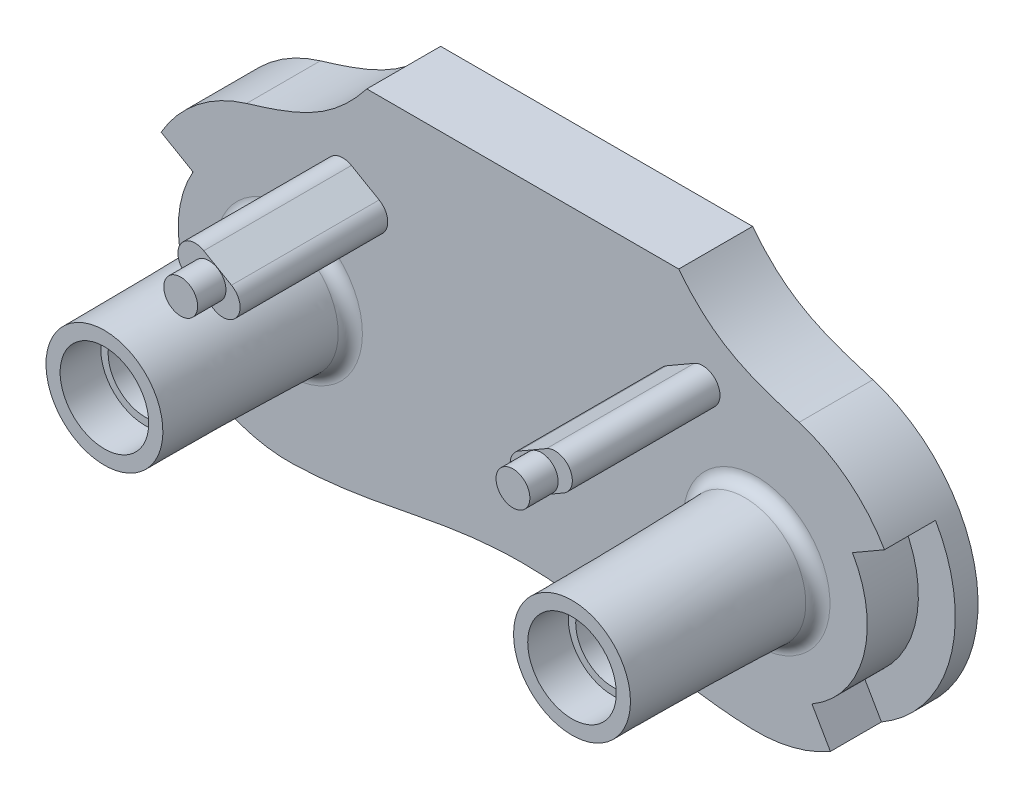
ISO-10303-21;
HEADER;
FILE_DESCRIPTION(('STEP AP214'),'2;1');
FILE_NAME('part.step','',(''),(''),'','','');
FILE_SCHEMA(('AUTOMOTIVE_DESIGN { 1 0 10303 214 1 1 1 1 }'));
ENDSEC;
DATA;
#1=APPLICATION_CONTEXT('core data for automotive mechanical design processes');
#2=APPLICATION_PROTOCOL_DEFINITION('international standard','automotive_design',2000,#1);
#3=PRODUCT_CONTEXT('',#1,'mechanical');
#4=PRODUCT('Part','Part','',(#3));
#5=PRODUCT_RELATED_PRODUCT_CATEGORY('part','',(#4));
#6=PRODUCT_DEFINITION_FORMATION('','',#4);
#7=PRODUCT_DEFINITION_CONTEXT('part definition',#1,'design');
#8=PRODUCT_DEFINITION('design','',#6,#7);
#9=PRODUCT_DEFINITION_SHAPE('','',#8);
#10=(LENGTH_UNIT() NAMED_UNIT(*) SI_UNIT(.MILLI.,.METRE.));
#11=(NAMED_UNIT(*) PLANE_ANGLE_UNIT() SI_UNIT($,.RADIAN.));
#12=(NAMED_UNIT(*) SI_UNIT($,.STERADIAN.) SOLID_ANGLE_UNIT());
#13=UNCERTAINTY_MEASURE_WITH_UNIT(LENGTH_MEASURE(1.E-05),#10,'distance_accuracy_value','');
#14=(GEOMETRIC_REPRESENTATION_CONTEXT(3) GLOBAL_UNCERTAINTY_ASSIGNED_CONTEXT((#13)) GLOBAL_UNIT_ASSIGNED_CONTEXT((#10,
#11,#12)) REPRESENTATION_CONTEXT('',''));
#15=CARTESIAN_POINT('',(0.,0.,0.));
#16=DIRECTION('',(0.,0.,1.));
#17=DIRECTION('',(1.,0.,0.));
#18=AXIS2_PLACEMENT_3D('',#15,#16,#17);
#19=CARTESIAN_POINT('',(-13.5,7.04908888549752,12.));
#20=DIRECTION('',(0.,0.,1.));
#21=DIRECTION('',(1.,0.,0.));
#22=AXIS2_PLACEMENT_3D('',#19,#20,#21);
#23=CYLINDRICAL_SURFACE('',#22,1.375);
#24=CARTESIAN_POINT('',(-13.5,7.04908888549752,12.));
#25=DIRECTION('',(0.,0.,1.));
#26=DIRECTION('',(1.,0.,0.));
#27=AXIS2_PLACEMENT_3D('',#24,#25,#26);
#28=CIRCLE('',#27,1.375);
#29=CARTESIAN_POINT('',(-12.125,7.04908888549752,12.));
#30=VERTEX_POINT('',#29);
#31=EDGE_CURVE('E461',#30,#30,#28,.T.);
#32=ORIENTED_EDGE('',*,*,#31,.T.);
#33=EDGE_LOOP('',(#32));
#34=FACE_BOUND('',#33,.T.);
#35=CARTESIAN_POINT('',(-13.5,7.04908888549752,14.3));
#36=DIRECTION('',(0.,0.,1.));
#37=DIRECTION('',(1.,0.,0.));
#38=AXIS2_PLACEMENT_3D('',#35,#36,#37);
#39=CIRCLE('',#38,1.375);
#40=CARTESIAN_POINT('',(-12.125,7.04908888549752,14.3));
#41=VERTEX_POINT('',#40);
#42=EDGE_CURVE('E47',#41,#41,#39,.F.);
#43=ORIENTED_EDGE('',*,*,#42,.T.);
#44=EDGE_LOOP('',(#43));
#45=FACE_BOUND('',#44,.T.);
#46=ADVANCED_FACE('F44',(#34,#45),#23,.T.);
#47=CARTESIAN_POINT('',(-12.3741669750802,6.39908888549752,14.7));
#48=DIRECTION('',(0.,0.,-1.));
#49=DIRECTION('',(-1.,0.,0.));
#50=AXIS2_PLACEMENT_3D('',#47,#48,#49);
#51=CYLINDRICAL_SURFACE('',#50,1.4);
#52=CARTESIAN_POINT('',(-12.3741669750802,6.39908888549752,12.));
#53=DIRECTION('',(0.,0.,1.));
#54=DIRECTION('',(1.,0.,0.));
#55=AXIS2_PLACEMENT_3D('',#52,#53,#54);
#56=CIRCLE('',#55,1.4);
#57=CARTESIAN_POINT('',(-13.0741669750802,5.1866533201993,12.));
#58=VERTEX_POINT('',#57);
#59=CARTESIAN_POINT('',(-11.6741669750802,7.61152445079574,12.));
#60=VERTEX_POINT('',#59);
#61=EDGE_CURVE('E199',#58,#60,#56,.T.);
#62=ORIENTED_EDGE('',*,*,#61,.F.);
#63=DIRECTION('',(0.,0.,-1.));
#64=VECTOR('',#63,1.);
#65=CARTESIAN_POINT('',(-13.0741669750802,5.1866533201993,14.7));
#66=LINE('',#65,#64);
#67=CARTESIAN_POINT('',(-13.0741669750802,5.1866533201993,0.));
#68=VERTEX_POINT('',#67);
#69=EDGE_CURVE('E214',#58,#68,#66,.T.);
#70=ORIENTED_EDGE('',*,*,#69,.T.);
#71=CARTESIAN_POINT('',(-12.3741669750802,6.39908888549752,0.));
#72=DIRECTION('',(0.,0.,1.));
#73=DIRECTION('',(1.,0.,0.));
#74=AXIS2_PLACEMENT_3D('',#71,#72,#73);
#75=CIRCLE('',#74,1.4);
#76=CARTESIAN_POINT('',(-11.6741669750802,7.61152445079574,0.));
#77=VERTEX_POINT('',#76);
#78=EDGE_CURVE('E255',#68,#77,#75,.T.);
#79=ORIENTED_EDGE('',*,*,#78,.T.);
#80=DIRECTION('',(0.,0.,-1.));
#81=VECTOR('',#80,1.);
#82=CARTESIAN_POINT('',(-11.6741669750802,7.61152445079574,14.7));
#83=LINE('',#82,#81);
#84=EDGE_CURVE('E215',#60,#77,#83,.T.);
#85=ORIENTED_EDGE('',*,*,#84,.F.);
#86=EDGE_LOOP('',(#62,#70,#79,#85));
#87=FACE_BOUND('',#86,.T.);
#88=ADVANCED_FACE('F206',(#87),#51,.T.);
#89=CARTESIAN_POINT('',(-11.6741669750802,7.61152445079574,14.7));
#90=DIRECTION('',(-0.499999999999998,-0.86602540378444,0.));
#91=DIRECTION('',(0.86602540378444,-0.499999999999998,0.));
#92=AXIS2_PLACEMENT_3D('',#89,#90,#91);
#93=PLANE('',#92);
#94=DIRECTION('',(-0.86602540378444,0.499999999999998,0.));
#95=VECTOR('',#94,1.);
#96=CARTESIAN_POINT('',(-11.6741669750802,7.61152445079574,12.));
#97=LINE('',#96,#95);
#98=CARTESIAN_POINT('',(-13.9258330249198,8.91152445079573,12.));
#99=VERTEX_POINT('',#98);
#100=EDGE_CURVE('E213',#60,#99,#97,.T.);
#101=ORIENTED_EDGE('',*,*,#100,.F.);
#102=ORIENTED_EDGE('',*,*,#84,.T.);
#103=DIRECTION('',(-0.86602540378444,0.499999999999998,0.));
#104=VECTOR('',#103,1.);
#105=CARTESIAN_POINT('',(-11.6741669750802,7.61152445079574,0.));
#106=LINE('',#105,#104);
#107=CARTESIAN_POINT('',(-13.9258330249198,8.91152445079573,0.));
#108=VERTEX_POINT('',#107);
#109=EDGE_CURVE('E452',#77,#108,#106,.T.);
#110=ORIENTED_EDGE('',*,*,#109,.T.);
#111=DIRECTION('',(0.,0.,-1.));
#112=VECTOR('',#111,1.);
#113=CARTESIAN_POINT('',(-13.9258330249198,8.91152445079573,14.7));
#114=LINE('',#113,#112);
#115=EDGE_CURVE('E224',#99,#108,#114,.T.);
#116=ORIENTED_EDGE('',*,*,#115,.F.);
#117=EDGE_LOOP('',(#101,#102,#110,#116));
#118=FACE_BOUND('',#117,.T.);
#119=ADVANCED_FACE('F302',(#118),#93,.F.);
#120=CARTESIAN_POINT('',(-14.6258330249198,7.69908888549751,14.7));
#121=DIRECTION('',(0.,0.,-1.));
#122=DIRECTION('',(-1.,0.,0.));
#123=AXIS2_PLACEMENT_3D('',#120,#121,#122);
#124=CYLINDRICAL_SURFACE('',#123,1.4);
#125=CARTESIAN_POINT('',(-14.6258330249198,7.69908888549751,12.));
#126=DIRECTION('',(0.,0.,1.));
#127=DIRECTION('',(1.,0.,0.));
#128=AXIS2_PLACEMENT_3D('',#125,#126,#127);
#129=CIRCLE('',#128,1.4);
#130=CARTESIAN_POINT('',(-15.3258330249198,6.4866533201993,12.));
#131=VERTEX_POINT('',#130);
#132=EDGE_CURVE('E69',#99,#131,#129,.T.);
#133=ORIENTED_EDGE('',*,*,#132,.F.);
#134=ORIENTED_EDGE('',*,*,#115,.T.);
#135=CARTESIAN_POINT('',(-14.6258330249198,7.69908888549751,0.));
#136=DIRECTION('',(0.,0.,1.));
#137=DIRECTION('',(1.,0.,0.));
#138=AXIS2_PLACEMENT_3D('',#135,#136,#137);
#139=CIRCLE('',#138,1.4);
#140=CARTESIAN_POINT('',(-15.3258330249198,6.4866533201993,0.));
#141=VERTEX_POINT('',#140);
#142=EDGE_CURVE('E225',#108,#141,#139,.T.);
#143=ORIENTED_EDGE('',*,*,#142,.T.);
#144=DIRECTION('',(0.,0.,-1.));
#145=VECTOR('',#144,1.);
#146=CARTESIAN_POINT('',(-15.3258330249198,6.4866533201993,14.7));
#147=LINE('',#146,#145);
#148=EDGE_CURVE('E216',#131,#141,#147,.T.);
#149=ORIENTED_EDGE('',*,*,#148,.F.);
#150=EDGE_LOOP('',(#133,#134,#143,#149));
#151=FACE_BOUND('',#150,.T.);
#152=ADVANCED_FACE('F457',(#151),#124,.T.);
#153=CARTESIAN_POINT('',(-13.0741669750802,5.1866533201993,14.7));
#154=DIRECTION('',(0.499999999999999,0.86602540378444,0.));
#155=DIRECTION('',(-0.86602540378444,0.499999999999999,0.));
#156=AXIS2_PLACEMENT_3D('',#153,#154,#155);
#157=PLANE('',#156);
#158=DIRECTION('',(0.86602540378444,-0.499999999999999,0.));
#159=VECTOR('',#158,1.);
#160=CARTESIAN_POINT('',(-13.0741669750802,5.1866533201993,12.));
#161=LINE('',#160,#159);
#162=EDGE_CURVE('E53',#131,#58,#161,.T.);
#163=ORIENTED_EDGE('',*,*,#162,.F.);
#164=ORIENTED_EDGE('',*,*,#148,.T.);
#165=DIRECTION('',(0.866025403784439,-0.499999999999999,0.));
#166=VECTOR('',#165,1.);
#167=CARTESIAN_POINT('',(-13.0741669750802,5.1866533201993,0.));
#168=LINE('',#167,#166);
#169=EDGE_CURVE('E219',#141,#68,#168,.T.);
#170=ORIENTED_EDGE('',*,*,#169,.T.);
#171=ORIENTED_EDGE('',*,*,#69,.F.);
#172=EDGE_LOOP('',(#163,#164,#170,#171));
#173=FACE_BOUND('',#172,.T.);
#174=ADVANCED_FACE('F220',(#173),#157,.F.);
#175=CARTESIAN_POINT('',(19.,-2.4771905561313,-6.));
#176=DIRECTION('',(0.,0.,1.));
#177=DIRECTION('',(1.,0.,0.));
#178=AXIS2_PLACEMENT_3D('',#175,#176,#177);
#179=CYLINDRICAL_SURFACE('',#178,12.);
#180=CARTESIAN_POINT('',(19.,-2.4771905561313,-4.15));
#181=DIRECTION('',(0.,0.,-1.));
#182=DIRECTION('',(-1.,0.,0.));
#183=AXIS2_PLACEMENT_3D('',#180,#181,#182);
#184=CIRCLE('',#183,12.);
#185=CARTESIAN_POINT('',(29.3923048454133,3.52280944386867,-4.15));
#186=VERTEX_POINT('',#185);
#187=CARTESIAN_POINT('',(24.9999999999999,-12.8694954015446,-4.15));
#188=VERTEX_POINT('',#187);
#189=EDGE_CURVE('E475',#186,#188,#184,.T.);
#190=ORIENTED_EDGE('',*,*,#189,.T.);
#191=DIRECTION('',(0.,0.,1.));
#192=VECTOR('',#191,1.);
#193=CARTESIAN_POINT('',(24.9999999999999,-12.8694954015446,-4.15));
#194=LINE('',#193,#192);
#195=CARTESIAN_POINT('',(24.9999999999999,-12.8694954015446,0.));
#196=VERTEX_POINT('',#195);
#197=EDGE_CURVE('E495',#188,#196,#194,.T.);
#198=ORIENTED_EDGE('',*,*,#197,.T.);
#199=CARTESIAN_POINT('',(19.,-2.4771905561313,0.));
#200=DIRECTION('',(0.,0.,1.));
#201=DIRECTION('',(-1.,0.,0.));
#202=AXIS2_PLACEMENT_3D('',#199,#200,#201);
#203=CIRCLE('',#202,12.);
#204=CARTESIAN_POINT('',(18.5752367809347,-14.4696705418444,0.));
#205=VERTEX_POINT('',#204);
#206=EDGE_CURVE('E651',#205,#196,#203,.T.);
#207=ORIENTED_EDGE('',*,*,#206,.F.);
#208=DIRECTION('',(0.,0.,1.));
#209=VECTOR('',#208,1.);
#210=CARTESIAN_POINT('',(18.5752367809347,-14.4696705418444,-6.));
#211=LINE('',#210,#209);
#212=CARTESIAN_POINT('',(18.5752367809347,-14.4696705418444,-6.));
#213=VERTEX_POINT('',#212);
#214=EDGE_CURVE('E688',#213,#205,#211,.T.);
#215=ORIENTED_EDGE('',*,*,#214,.F.);
#216=CARTESIAN_POINT('',(19.,-2.4771905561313,-6.));
#217=DIRECTION('',(0.,0.,1.));
#218=DIRECTION('',(-1.,0.,0.));
#219=AXIS2_PLACEMENT_3D('',#216,#217,#218);
#220=CIRCLE('',#219,12.);
#221=CARTESIAN_POINT('',(22.4481746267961,9.01672486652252,-6.));
#222=VERTEX_POINT('',#221);
#223=EDGE_CURVE('E710',#213,#222,#220,.T.);
#224=ORIENTED_EDGE('',*,*,#223,.T.);
#225=DIRECTION('',(0.,0.,1.));
#226=VECTOR('',#225,1.);
#227=CARTESIAN_POINT('',(22.4481746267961,9.01672486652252,-6.));
#228=LINE('',#227,#226);
#229=CARTESIAN_POINT('',(22.4481746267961,9.01672486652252,0.));
#230=VERTEX_POINT('',#229);
#231=EDGE_CURVE('E686',#222,#230,#228,.T.);
#232=ORIENTED_EDGE('',*,*,#231,.T.);
#233=CARTESIAN_POINT('',(29.3923048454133,3.52280944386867,0.));
#234=VERTEX_POINT('',#233);
#235=EDGE_CURVE('E649',#234,#230,#203,.T.);
#236=ORIENTED_EDGE('',*,*,#235,.F.);
#237=DIRECTION('',(0.,0.,1.));
#238=VECTOR('',#237,1.);
#239=CARTESIAN_POINT('',(29.3923048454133,3.52280944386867,-4.15));
#240=LINE('',#239,#238);
#241=EDGE_CURVE('E485',#186,#234,#240,.T.);
#242=ORIENTED_EDGE('',*,*,#241,.F.);
#243=EDGE_LOOP('',(#190,#198,#207,#215,#224,#232,#236,#242));
#244=FACE_BOUND('',#243,.T.);
#245=ADVANCED_FACE('F612',(#244),#179,.T.);
#246=CARTESIAN_POINT('',(-19.,-2.4771905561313,-6.));
#247=DIRECTION('',(0.,0.,1.));
#248=DIRECTION('',(1.,0.,0.));
#249=AXIS2_PLACEMENT_3D('',#246,#247,#248);
#250=CYLINDRICAL_SURFACE('',#249,12.);
#251=CARTESIAN_POINT('',(-19.,-2.4771905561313,-4.15));
#252=DIRECTION('',(0.,0.,1.));
#253=DIRECTION('',(1.,0.,0.));
#254=AXIS2_PLACEMENT_3D('',#251,#252,#253);
#255=CIRCLE('',#254,12.);
#256=CARTESIAN_POINT('',(-29.3923048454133,3.52280944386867,-4.15));
#257=VERTEX_POINT('',#256);
#258=CARTESIAN_POINT('',(-24.9999999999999,-12.8694954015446,-4.15));
#259=VERTEX_POINT('',#258);
#260=EDGE_CURVE('E501',#257,#259,#255,.T.);
#261=ORIENTED_EDGE('',*,*,#260,.F.);
#262=DIRECTION('',(0.,0.,1.));
#263=VECTOR('',#262,1.);
#264=CARTESIAN_POINT('',(-29.3923048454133,3.52280944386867,-4.15));
#265=LINE('',#264,#263);
#266=CARTESIAN_POINT('',(-29.3923048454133,3.52280944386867,0.));
#267=VERTEX_POINT('',#266);
#268=EDGE_CURVE('E516',#257,#267,#265,.T.);
#269=ORIENTED_EDGE('',*,*,#268,.T.);
#270=CARTESIAN_POINT('',(-19.,-2.4771905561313,0.));
#271=DIRECTION('',(0.,0.,1.));
#272=DIRECTION('',(1.,0.,0.));
#273=AXIS2_PLACEMENT_3D('',#270,#271,#272);
#274=CIRCLE('',#273,12.);
#275=CARTESIAN_POINT('',(-22.4481746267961,9.01672486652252,0.));
#276=VERTEX_POINT('',#275);
#277=EDGE_CURVE('E259',#276,#267,#274,.T.);
#278=ORIENTED_EDGE('',*,*,#277,.F.);
#279=DIRECTION('',(0.,0.,1.));
#280=VECTOR('',#279,1.);
#281=CARTESIAN_POINT('',(-22.4481746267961,9.01672486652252,-6.));
#282=LINE('',#281,#280);
#283=CARTESIAN_POINT('',(-22.4481746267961,9.01672486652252,-6.));
#284=VERTEX_POINT('',#283);
#285=EDGE_CURVE('E682',#284,#276,#282,.T.);
#286=ORIENTED_EDGE('',*,*,#285,.F.);
#287=CARTESIAN_POINT('',(-19.,-2.4771905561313,-6.));
#288=DIRECTION('',(0.,0.,1.));
#289=DIRECTION('',(1.,0.,0.));
#290=AXIS2_PLACEMENT_3D('',#287,#288,#289);
#291=CIRCLE('',#290,12.);
#292=CARTESIAN_POINT('',(-18.5752367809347,-14.4696705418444,-6.));
#293=VERTEX_POINT('',#292);
#294=EDGE_CURVE('E626',#284,#293,#291,.T.);
#295=ORIENTED_EDGE('',*,*,#294,.T.);
#296=DIRECTION('',(0.,0.,1.));
#297=VECTOR('',#296,1.);
#298=CARTESIAN_POINT('',(-18.5752367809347,-14.4696705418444,-6.));
#299=LINE('',#298,#297);
#300=CARTESIAN_POINT('',(-18.5752367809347,-14.4696705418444,0.));
#301=VERTEX_POINT('',#300);
#302=EDGE_CURVE('E561',#293,#301,#299,.T.);
#303=ORIENTED_EDGE('',*,*,#302,.T.);
#304=CARTESIAN_POINT('',(-24.9999999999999,-12.8694954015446,0.));
#305=VERTEX_POINT('',#304);
#306=EDGE_CURVE('E672',#305,#301,#274,.T.);
#307=ORIENTED_EDGE('',*,*,#306,.F.);
#308=DIRECTION('',(0.,0.,1.));
#309=VECTOR('',#308,1.);
#310=CARTESIAN_POINT('',(-24.9999999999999,-12.8694954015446,-4.15));
#311=LINE('',#310,#309);
#312=EDGE_CURVE('E515',#259,#305,#311,.T.);
#313=ORIENTED_EDGE('',*,*,#312,.F.);
#314=EDGE_LOOP('',(#261,#269,#278,#286,#295,#303,#307,#313));
#315=FACE_BOUND('',#314,.T.);
#316=ADVANCED_FACE('F368',(#315),#250,.T.);
#317=CARTESIAN_POINT('',(19.,-2.4771905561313,20.));
#318=DIRECTION('',(0.,0.,-1.));
#319=DIRECTION('',(-1.,0.,0.));
#320=AXIS2_PLACEMENT_3D('',#317,#318,#319);
#321=CYLINDRICAL_SURFACE('',#320,3.);
#322=CARTESIAN_POINT('',(19.,-2.4771905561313,-6.));
#323=DIRECTION('',(0.,0.,-1.));
#324=DIRECTION('',(-1.,0.,0.));
#325=AXIS2_PLACEMENT_3D('',#322,#323,#324);
#326=CIRCLE('',#325,3.);
#327=CARTESIAN_POINT('',(16.,-2.4771905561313,-6.));
#328=VERTEX_POINT('',#327);
#329=EDGE_CURVE('E545',#328,#328,#326,.F.);
#330=ORIENTED_EDGE('',*,*,#329,.F.);
#331=EDGE_LOOP('',(#330));
#332=FACE_BOUND('',#331,.T.);
#333=CARTESIAN_POINT('',(19.,-2.4771905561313,11.7));
#334=DIRECTION('',(0.,0.,1.));
#335=DIRECTION('',(1.,0.,0.));
#336=AXIS2_PLACEMENT_3D('',#333,#334,#335);
#337=CIRCLE('',#336,3.);
#338=CARTESIAN_POINT('',(22.,-2.4771905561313,11.7));
#339=VERTEX_POINT('',#338);
#340=EDGE_CURVE('E535',#339,#339,#337,.T.);
#341=ORIENTED_EDGE('',*,*,#340,.T.);
#342=EDGE_LOOP('',(#341));
#343=FACE_BOUND('',#342,.T.);
#344=ADVANCED_FACE('F363',(#332,#343),#321,.F.);
#345=CARTESIAN_POINT('',(-19.,-2.4771905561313,20.));
#346=DIRECTION('',(0.,0.,-1.));
#347=DIRECTION('',(-1.,0.,0.));
#348=AXIS2_PLACEMENT_3D('',#345,#346,#347);
#349=CYLINDRICAL_SURFACE('',#348,3.);
#350=CARTESIAN_POINT('',(-19.,-2.4771905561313,-6.));
#351=DIRECTION('',(0.,0.,-1.));
#352=DIRECTION('',(-1.,0.,0.));
#353=AXIS2_PLACEMENT_3D('',#350,#351,#352);
#354=CIRCLE('',#353,3.);
#355=CARTESIAN_POINT('',(-22.,-2.4771905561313,-6.));
#356=VERTEX_POINT('',#355);
#357=EDGE_CURVE('E544',#356,#356,#354,.F.);
#358=ORIENTED_EDGE('',*,*,#357,.F.);
#359=EDGE_LOOP('',(#358));
#360=FACE_BOUND('',#359,.T.);
#361=CARTESIAN_POINT('',(-19.,-2.4771905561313,11.7));
#362=DIRECTION('',(0.,0.,1.));
#363=DIRECTION('',(1.,0.,0.));
#364=AXIS2_PLACEMENT_3D('',#361,#362,#363);
#365=CIRCLE('',#364,3.);
#366=CARTESIAN_POINT('',(-16.,-2.4771905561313,11.7));
#367=VERTEX_POINT('',#366);
#368=EDGE_CURVE('E540',#367,#367,#365,.T.);
#369=ORIENTED_EDGE('',*,*,#368,.T.);
#370=EDGE_LOOP('',(#369));
#371=FACE_BOUND('',#370,.T.);
#372=ADVANCED_FACE('F364',(#360,#371),#349,.F.);
#373=CARTESIAN_POINT('',(-9.17558471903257,-13.1948473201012,0.));
#374=DIRECTION('',(0.,0.,-1.));
#375=DIRECTION('',(-1.,0.,0.));
#376=AXIS2_PLACEMENT_3D('',#373,#374,#375);
#377=PLANE('',#376);
#378=CARTESIAN_POINT('',(19.,-2.4771905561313,0.));
#379=DIRECTION('',(0.,0.,1.));
#380=DIRECTION('',(-1.,0.,0.));
#381=AXIS2_PLACEMENT_3D('',#378,#379,#380);
#382=CIRCLE('',#381,9.);
#383=CARTESIAN_POINT('',(23.5,-10.2714191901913,0.));
#384=VERTEX_POINT('',#383);
#385=CARTESIAN_POINT('',(26.79422863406,2.02280944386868,0.));
#386=VERTEX_POINT('',#385);
#387=EDGE_CURVE('E490',#384,#386,#382,.T.);
#388=ORIENTED_EDGE('',*,*,#387,.T.);
#389=DIRECTION('',(0.86602540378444,0.499999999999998,0.));
#390=VECTOR('',#389,1.);
#391=CARTESIAN_POINT('',(26.79422863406,2.02280944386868,0.));
#392=LINE('',#391,#390);
#393=EDGE_CURVE('E472',#386,#234,#392,.T.);
#394=ORIENTED_EDGE('',*,*,#393,.T.);
#395=ORIENTED_EDGE('',*,*,#235,.T.);
#396=CARTESIAN_POINT('',(22.4481746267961,9.01672486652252,0.));
#397=CARTESIAN_POINT('',(18.2187669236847,10.2855471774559,0.));
#398=CARTESIAN_POINT('',(15.492615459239,11.3176864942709,0.));
#399=CARTESIAN_POINT('',(12.6747991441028,14.9250647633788,0.));
#400=B_SPLINE_CURVE_WITH_KNOTS('',3,(#396,#397,#398,#399),.UNSPECIFIED.,.F.,.F.,(4,4),(0.,1.),.UNSPECIFIED.);
#401=CARTESIAN_POINT('',(12.6747991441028,14.9250647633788,0.));
#402=VERTEX_POINT('',#401);
#403=EDGE_CURVE('E660',#230,#402,#400,.T.);
#404=ORIENTED_EDGE('',*,*,#403,.T.);
#405=DIRECTION('',(-1.,0.,0.));
#406=VECTOR('',#405,1.);
#407=CARTESIAN_POINT('',(-12.6747991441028,14.9250647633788,0.));
#408=LINE('',#407,#406);
#409=CARTESIAN_POINT('',(-12.6747991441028,14.9250647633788,0.));
#410=VERTEX_POINT('',#409);
#411=EDGE_CURVE('E661',#402,#410,#408,.T.);
#412=ORIENTED_EDGE('',*,*,#411,.T.);
#413=CARTESIAN_POINT('',(-12.6747991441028,14.9250647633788,0.));
#414=CARTESIAN_POINT('',(-15.492615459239,11.3176864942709,0.));
#415=CARTESIAN_POINT('',(-18.2187669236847,10.2855471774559,0.));
#416=CARTESIAN_POINT('',(-22.4481746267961,9.01672486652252,0.));
#417=B_SPLINE_CURVE_WITH_KNOTS('',3,(#413,#414,#415,#416),.UNSPECIFIED.,.F.,.F.,(4,4),(0.,1.),.UNSPECIFIED.);
#418=EDGE_CURVE('E668',#410,#276,#417,.T.);
#419=ORIENTED_EDGE('',*,*,#418,.T.);
#420=ORIENTED_EDGE('',*,*,#277,.T.);
#421=DIRECTION('',(-0.86602540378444,0.499999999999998,0.));
#422=VECTOR('',#421,1.);
#423=CARTESIAN_POINT('',(-26.79422863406,2.02280944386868,0.));
#424=LINE('',#423,#422);
#425=CARTESIAN_POINT('',(-26.79422863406,2.02280944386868,0.));
#426=VERTEX_POINT('',#425);
#427=EDGE_CURVE('E504',#426,#267,#424,.T.);
#428=ORIENTED_EDGE('',*,*,#427,.F.);
#429=CARTESIAN_POINT('',(-19.,-2.4771905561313,0.));
#430=DIRECTION('',(0.,0.,-1.));
#431=DIRECTION('',(1.,0.,0.));
#432=AXIS2_PLACEMENT_3D('',#429,#430,#431);
#433=CIRCLE('',#432,9.);
#434=CARTESIAN_POINT('',(-23.5,-10.2714191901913,0.));
#435=VERTEX_POINT('',#434);
#436=EDGE_CURVE('E517',#435,#426,#433,.T.);
#437=ORIENTED_EDGE('',*,*,#436,.F.);
#438=DIRECTION('',(0.499999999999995,0.866025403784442,0.));
#439=VECTOR('',#438,1.);
#440=CARTESIAN_POINT('',(-23.4999999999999,-10.2714191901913,0.));
#441=LINE('',#440,#439);
#442=EDGE_CURVE('E494',#305,#435,#441,.T.);
#443=ORIENTED_EDGE('',*,*,#442,.F.);
#444=ORIENTED_EDGE('',*,*,#306,.T.);
#445=CARTESIAN_POINT('',(-18.5752367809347,-14.4696705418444,0.));
#446=CARTESIAN_POINT('',(-11.393763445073,-14.215308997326,0.));
#447=CARTESIAN_POINT('',(-6.88271687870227,-12.1107952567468,0.));
#448=CARTESIAN_POINT('',(0.,-12.1107952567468,0.));
#449=B_SPLINE_CURVE_WITH_KNOTS('',3,(#445,#446,#447,#448),.UNSPECIFIED.,.F.,.F.,(4,4),(0.,1.),.UNSPECIFIED.);
#450=CARTESIAN_POINT('',(0.,-12.1107952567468,0.));
#451=VERTEX_POINT('',#450);
#452=EDGE_CURVE('E226',#301,#451,#449,.T.);
#453=ORIENTED_EDGE('',*,*,#452,.T.);
#454=CARTESIAN_POINT('',(0.,-12.1107952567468,0.));
#455=CARTESIAN_POINT('',(6.88271687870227,-12.1107952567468,0.));
#456=CARTESIAN_POINT('',(11.393763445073,-14.215308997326,0.));
#457=CARTESIAN_POINT('',(18.5752367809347,-14.4696705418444,0.));
#458=B_SPLINE_CURVE_WITH_KNOTS('',3,(#454,#455,#456,#457),.UNSPECIFIED.,.F.,.F.,(4,4),(0.,1.),.UNSPECIFIED.);
#459=EDGE_CURVE('E645',#451,#205,#458,.T.);
#460=ORIENTED_EDGE('',*,*,#459,.T.);
#461=ORIENTED_EDGE('',*,*,#206,.T.);
#462=DIRECTION('',(-0.499999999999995,0.866025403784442,0.));
#463=VECTOR('',#462,1.);
#464=CARTESIAN_POINT('',(23.4999999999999,-10.2714191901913,0.));
#465=LINE('',#464,#463);
#466=EDGE_CURVE('E478',#196,#384,#465,.T.);
#467=ORIENTED_EDGE('',*,*,#466,.T.);
#468=EDGE_LOOP('',(#388,#394,#395,#404,#412,#419,#420,#428,#437,#443,#444,#453,#460,#461,#467));
#469=FACE_BOUND('',#468,.T.);
#470=CARTESIAN_POINT('',(19.,-2.4771905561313,0.));
#471=DIRECTION('',(0.,0.,-1.));
#472=DIRECTION('',(-1.,0.,0.));
#473=AXIS2_PLACEMENT_3D('',#470,#471,#472);
#474=CIRCLE('',#473,5.96625720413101);
#475=CARTESIAN_POINT('',(13.033742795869,-2.4771905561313,0.));
#476=VERTEX_POINT('',#475);
#477=EDGE_CURVE('E565',#476,#476,#474,.T.);
#478=ORIENTED_EDGE('',*,*,#477,.T.);
#479=EDGE_LOOP('',(#478));
#480=FACE_BOUND('',#479,.T.);
#481=CARTESIAN_POINT('',(-19.,-2.4771905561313,0.));
#482=DIRECTION('',(0.,0.,-1.));
#483=DIRECTION('',(-1.,0.,0.));
#484=AXIS2_PLACEMENT_3D('',#481,#482,#483);
#485=CIRCLE('',#484,5.966257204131);
#486=CARTESIAN_POINT('',(-24.966257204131,-2.4771905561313,0.));
#487=VERTEX_POINT('',#486);
#488=EDGE_CURVE('E560',#487,#487,#485,.T.);
#489=ORIENTED_EDGE('',*,*,#488,.T.);
#490=EDGE_LOOP('',(#489));
#491=FACE_BOUND('',#490,.T.);
#492=CARTESIAN_POINT('',(12.3741669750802,6.39908888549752,0.));
#493=DIRECTION('',(0.,0.,1.));
#494=DIRECTION('',(-1.,0.,0.));
#495=AXIS2_PLACEMENT_3D('',#492,#493,#494);
#496=CIRCLE('',#495,1.4);
#497=CARTESIAN_POINT('',(11.6741669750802,7.61152445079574,0.));
#498=VERTEX_POINT('',#497);
#499=CARTESIAN_POINT('',(13.0741669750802,5.1866533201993,0.));
#500=VERTEX_POINT('',#499);
#501=EDGE_CURVE('E250',#498,#500,#496,.T.);
#502=ORIENTED_EDGE('',*,*,#501,.F.);
#503=DIRECTION('',(-0.86602540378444,-0.499999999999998,0.));
#504=VECTOR('',#503,1.);
#505=CARTESIAN_POINT('',(11.6741669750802,7.61152445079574,0.));
#506=LINE('',#505,#504);
#507=CARTESIAN_POINT('',(13.9258330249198,8.91152445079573,0.));
#508=VERTEX_POINT('',#507);
#509=EDGE_CURVE('E237',#508,#498,#506,.T.);
#510=ORIENTED_EDGE('',*,*,#509,.F.);
#511=CARTESIAN_POINT('',(14.6258330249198,7.69908888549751,0.));
#512=DIRECTION('',(0.,0.,1.));
#513=DIRECTION('',(-1.,0.,0.));
#514=AXIS2_PLACEMENT_3D('',#511,#512,#513);
#515=CIRCLE('',#514,1.4);
#516=CARTESIAN_POINT('',(15.3258330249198,6.48665332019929,0.));
#517=VERTEX_POINT('',#516);
#518=EDGE_CURVE('E243',#517,#508,#515,.T.);
#519=ORIENTED_EDGE('',*,*,#518,.F.);
#520=DIRECTION('',(0.86602540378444,0.499999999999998,0.));
#521=VECTOR('',#520,1.);
#522=CARTESIAN_POINT('',(13.0741669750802,5.1866533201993,0.));
#523=LINE('',#522,#521);
#524=EDGE_CURVE('E248',#500,#517,#523,.T.);
#525=ORIENTED_EDGE('',*,*,#524,.F.);
#526=EDGE_LOOP('',(#502,#510,#519,#525));
#527=FACE_BOUND('',#526,.T.);
#528=ORIENTED_EDGE('',*,*,#78,.F.);
#529=ORIENTED_EDGE('',*,*,#169,.F.);
#530=ORIENTED_EDGE('',*,*,#142,.F.);
#531=ORIENTED_EDGE('',*,*,#109,.F.);
#532=EDGE_LOOP('',(#528,#529,#530,#531));
#533=FACE_BOUND('',#532,.T.);
#534=ADVANCED_FACE('F273',(#469,#480,#491,#527,#533),#377,.F.);
#535=CARTESIAN_POINT('',(-18.5752367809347,-14.4696705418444,-6.));
#536=CARTESIAN_POINT('',(-11.393763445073,-14.215308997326,-6.));
#537=CARTESIAN_POINT('',(-6.88271687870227,-12.1107952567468,-6.));
#538=CARTESIAN_POINT('',(0.,-12.1107952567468,-6.));
#539=B_SPLINE_CURVE_WITH_KNOTS('',3,(#535,#536,#537,#538),.UNSPECIFIED.,.F.,.F.,(4,4),(0.,1.),.UNSPECIFIED.);
#540=DIRECTION('',(0.,0.,1.));
#541=VECTOR('',#540,1.);
#542=SURFACE_OF_LINEAR_EXTRUSION('',#539,#541);
#543=ORIENTED_EDGE('',*,*,#452,.F.);
#544=ORIENTED_EDGE('',*,*,#302,.F.);
#545=CARTESIAN_POINT('',(0.,-12.1107952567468,-6.));
#546=VERTEX_POINT('',#545);
#547=EDGE_CURVE('E253',#293,#546,#539,.T.);
#548=ORIENTED_EDGE('',*,*,#547,.T.);
#549=DIRECTION('',(0.,0.,1.));
#550=VECTOR('',#549,1.);
#551=CARTESIAN_POINT('',(0.,-12.1107952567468,-6.));
#552=LINE('',#551,#550);
#553=EDGE_CURVE('E557',#546,#451,#552,.T.);
#554=ORIENTED_EDGE('',*,*,#553,.T.);
#555=EDGE_LOOP('',(#543,#544,#548,#554));
#556=FACE_BOUND('',#555,.T.);
#557=ADVANCED_FACE('F267',(#556),#542,.T.);
#558=CARTESIAN_POINT('',(-12.6747991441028,14.9250647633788,-6.));
#559=CARTESIAN_POINT('',(-15.492615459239,11.3176864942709,-6.));
#560=CARTESIAN_POINT('',(-18.2187669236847,10.2855471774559,-6.));
#561=CARTESIAN_POINT('',(-22.4481746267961,9.01672486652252,-6.));
#562=B_SPLINE_CURVE_WITH_KNOTS('',3,(#558,#559,#560,#561),.UNSPECIFIED.,.F.,.F.,(4,4),(0.,1.),.UNSPECIFIED.);
#563=DIRECTION('',(0.,0.,1.));
#564=VECTOR('',#563,1.);
#565=SURFACE_OF_LINEAR_EXTRUSION('',#562,#564);
#566=ORIENTED_EDGE('',*,*,#418,.F.);
#567=DIRECTION('',(0.,0.,1.));
#568=VECTOR('',#567,1.);
#569=CARTESIAN_POINT('',(-12.6747991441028,14.9250647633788,-6.));
#570=LINE('',#569,#568);
#571=CARTESIAN_POINT('',(-12.6747991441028,14.9250647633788,-6.));
#572=VERTEX_POINT('',#571);
#573=EDGE_CURVE('E681',#572,#410,#570,.T.);
#574=ORIENTED_EDGE('',*,*,#573,.F.);
#575=EDGE_CURVE('E622',#572,#284,#562,.T.);
#576=ORIENTED_EDGE('',*,*,#575,.T.);
#577=ORIENTED_EDGE('',*,*,#285,.T.);
#578=EDGE_LOOP('',(#566,#574,#576,#577));
#579=FACE_BOUND('',#578,.T.);
#580=ADVANCED_FACE('F275',(#579),#565,.T.);
#581=CARTESIAN_POINT('',(-12.6747991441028,14.9250647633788,-6.));
#582=DIRECTION('',(0.,1.,0.));
#583=DIRECTION('',(0.,0.,1.));
#584=AXIS2_PLACEMENT_3D('',#581,#582,#583);
#585=PLANE('',#584);
#586=ORIENTED_EDGE('',*,*,#411,.F.);
#587=DIRECTION('',(0.,0.,1.));
#588=VECTOR('',#587,1.);
#589=CARTESIAN_POINT('',(12.6747991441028,14.9250647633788,-6.));
#590=LINE('',#589,#588);
#591=CARTESIAN_POINT('',(12.6747991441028,14.9250647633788,-6.));
#592=VERTEX_POINT('',#591);
#593=EDGE_CURVE('E683',#592,#402,#590,.T.);
#594=ORIENTED_EDGE('',*,*,#593,.F.);
#595=DIRECTION('',(-1.,0.,0.));
#596=VECTOR('',#595,1.);
#597=CARTESIAN_POINT('',(-12.6747991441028,14.9250647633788,-6.));
#598=LINE('',#597,#596);
#599=EDGE_CURVE('E633',#592,#572,#598,.T.);
#600=ORIENTED_EDGE('',*,*,#599,.T.);
#601=ORIENTED_EDGE('',*,*,#573,.T.);
#602=EDGE_LOOP('',(#586,#594,#600,#601));
#603=FACE_BOUND('',#602,.T.);
#604=ADVANCED_FACE('F616',(#603),#585,.T.);
#605=CARTESIAN_POINT('',(22.4481746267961,9.01672486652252,-6.));
#606=CARTESIAN_POINT('',(18.2187669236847,10.2855471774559,-6.));
#607=CARTESIAN_POINT('',(15.492615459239,11.3176864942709,-6.));
#608=CARTESIAN_POINT('',(12.6747991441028,14.9250647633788,-6.));
#609=B_SPLINE_CURVE_WITH_KNOTS('',3,(#605,#606,#607,#608),.UNSPECIFIED.,.F.,.F.,(4,4),(0.,1.),.UNSPECIFIED.);
#610=DIRECTION('',(0.,0.,1.));
#611=VECTOR('',#610,1.);
#612=SURFACE_OF_LINEAR_EXTRUSION('',#609,#611);
#613=ORIENTED_EDGE('',*,*,#403,.F.);
#614=ORIENTED_EDGE('',*,*,#231,.F.);
#615=EDGE_CURVE('E709',#222,#592,#609,.T.);
#616=ORIENTED_EDGE('',*,*,#615,.T.);
#617=ORIENTED_EDGE('',*,*,#593,.T.);
#618=EDGE_LOOP('',(#613,#614,#616,#617));
#619=FACE_BOUND('',#618,.T.);
#620=ADVANCED_FACE('F717',(#619),#612,.T.);
#621=CARTESIAN_POINT('',(0.,-12.1107952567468,-6.));
#622=CARTESIAN_POINT('',(6.88271687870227,-12.1107952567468,-6.));
#623=CARTESIAN_POINT('',(11.393763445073,-14.215308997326,-6.));
#624=CARTESIAN_POINT('',(18.5752367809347,-14.4696705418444,-6.));
#625=B_SPLINE_CURVE_WITH_KNOTS('',3,(#621,#622,#623,#624),.UNSPECIFIED.,.F.,.F.,(4,4),(0.,1.),.UNSPECIFIED.);
#626=DIRECTION('',(0.,0.,1.));
#627=VECTOR('',#626,1.);
#628=SURFACE_OF_LINEAR_EXTRUSION('',#625,#627);
#629=ORIENTED_EDGE('',*,*,#459,.F.);
#630=ORIENTED_EDGE('',*,*,#553,.F.);
#631=EDGE_CURVE('E260',#546,#213,#625,.T.);
#632=ORIENTED_EDGE('',*,*,#631,.T.);
#633=ORIENTED_EDGE('',*,*,#214,.T.);
#634=EDGE_LOOP('',(#629,#630,#632,#633));
#635=FACE_BOUND('',#634,.T.);
#636=ADVANCED_FACE('F274',(#635),#628,.T.);
#637=CARTESIAN_POINT('',(-9.17558471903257,-13.1948473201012,-6.));
#638=DIRECTION('',(0.,0.,-1.));
#639=DIRECTION('',(-1.,0.,0.));
#640=AXIS2_PLACEMENT_3D('',#637,#638,#639);
#641=PLANE('',#640);
#642=ORIENTED_EDGE('',*,*,#357,.T.);
#643=EDGE_LOOP('',(#642));
#644=FACE_BOUND('',#643,.T.);
#645=ORIENTED_EDGE('',*,*,#329,.T.);
#646=EDGE_LOOP('',(#645));
#647=FACE_BOUND('',#646,.T.);
#648=ORIENTED_EDGE('',*,*,#547,.F.);
#649=ORIENTED_EDGE('',*,*,#294,.F.);
#650=ORIENTED_EDGE('',*,*,#575,.F.);
#651=ORIENTED_EDGE('',*,*,#599,.F.);
#652=ORIENTED_EDGE('',*,*,#615,.F.);
#653=ORIENTED_EDGE('',*,*,#223,.F.);
#654=ORIENTED_EDGE('',*,*,#631,.F.);
#655=EDGE_LOOP('',(#648,#649,#650,#651,#652,#653,#654));
#656=FACE_BOUND('',#655,.T.);
#657=ADVANCED_FACE('F550',(#644,#647,#656),#641,.T.);
#658=CARTESIAN_POINT('',(12.3741669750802,6.39908888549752,14.7));
#659=DIRECTION('',(0.,0.,-1.));
#660=DIRECTION('',(-1.,0.,0.));
#661=AXIS2_PLACEMENT_3D('',#658,#659,#660);
#662=CYLINDRICAL_SURFACE('',#661,1.4);
#663=DIRECTION('',(0.,0.,-1.));
#664=VECTOR('',#663,1.);
#665=CARTESIAN_POINT('',(13.0741669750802,5.1866533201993,14.7));
#666=LINE('',#665,#664);
#667=CARTESIAN_POINT('',(13.0741669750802,5.1866533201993,12.));
#668=VERTEX_POINT('',#667);
#669=EDGE_CURVE('E232',#668,#500,#666,.T.);
#670=ORIENTED_EDGE('',*,*,#669,.F.);
#671=CARTESIAN_POINT('',(12.3741669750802,6.39908888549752,12.));
#672=DIRECTION('',(0.,0.,-1.));
#673=DIRECTION('',(-1.,0.,0.));
#674=AXIS2_PLACEMENT_3D('',#671,#672,#673);
#675=CIRCLE('',#674,1.4);
#676=CARTESIAN_POINT('',(11.6741669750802,7.61152445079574,12.));
#677=VERTEX_POINT('',#676);
#678=EDGE_CURVE('E466',#668,#677,#675,.T.);
#679=ORIENTED_EDGE('',*,*,#678,.T.);
#680=DIRECTION('',(0.,0.,-1.));
#681=VECTOR('',#680,1.);
#682=CARTESIAN_POINT('',(11.6741669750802,7.61152445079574,14.7));
#683=LINE('',#682,#681);
#684=EDGE_CURVE('E240',#677,#498,#683,.T.);
#685=ORIENTED_EDGE('',*,*,#684,.T.);
#686=ORIENTED_EDGE('',*,*,#501,.T.);
#687=EDGE_LOOP('',(#670,#679,#685,#686));
#688=FACE_BOUND('',#687,.T.);
#689=ADVANCED_FACE('F599',(#688),#662,.T.);
#690=CARTESIAN_POINT('',(13.0741669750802,5.1866533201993,14.7));
#691=DIRECTION('',(-0.499999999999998,0.86602540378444,0.));
#692=DIRECTION('',(-0.86602540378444,-0.499999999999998,0.));
#693=AXIS2_PLACEMENT_3D('',#690,#691,#692);
#694=PLANE('',#693);
#695=DIRECTION('',(0.,0.,-1.));
#696=VECTOR('',#695,1.);
#697=CARTESIAN_POINT('',(15.3258330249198,6.48665332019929,14.7));
#698=LINE('',#697,#696);
#699=CARTESIAN_POINT('',(15.3258330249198,6.48665332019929,12.));
#700=VERTEX_POINT('',#699);
#701=EDGE_CURVE('E231',#700,#517,#698,.T.);
#702=ORIENTED_EDGE('',*,*,#701,.F.);
#703=DIRECTION('',(-0.86602540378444,-0.499999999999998,0.));
#704=VECTOR('',#703,1.);
#705=CARTESIAN_POINT('',(13.0741669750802,5.1866533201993,12.));
#706=LINE('',#705,#704);
#707=EDGE_CURVE('E470',#700,#668,#706,.T.);
#708=ORIENTED_EDGE('',*,*,#707,.T.);
#709=ORIENTED_EDGE('',*,*,#669,.T.);
#710=ORIENTED_EDGE('',*,*,#524,.T.);
#711=EDGE_LOOP('',(#702,#708,#709,#710));
#712=FACE_BOUND('',#711,.T.);
#713=ADVANCED_FACE('F592',(#712),#694,.F.);
#714=CARTESIAN_POINT('',(14.6258330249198,7.69908888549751,14.7));
#715=DIRECTION('',(0.,0.,-1.));
#716=DIRECTION('',(-1.,0.,0.));
#717=AXIS2_PLACEMENT_3D('',#714,#715,#716);
#718=CYLINDRICAL_SURFACE('',#717,1.4);
#719=DIRECTION('',(0.,0.,-1.));
#720=VECTOR('',#719,1.);
#721=CARTESIAN_POINT('',(13.9258330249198,8.91152445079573,14.7));
#722=LINE('',#721,#720);
#723=CARTESIAN_POINT('',(13.9258330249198,8.91152445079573,12.));
#724=VERTEX_POINT('',#723);
#725=EDGE_CURVE('E239',#724,#508,#722,.T.);
#726=ORIENTED_EDGE('',*,*,#725,.F.);
#727=CARTESIAN_POINT('',(14.6258330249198,7.69908888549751,12.));
#728=DIRECTION('',(0.,0.,-1.));
#729=DIRECTION('',(-1.,0.,0.));
#730=AXIS2_PLACEMENT_3D('',#727,#728,#729);
#731=CIRCLE('',#730,1.4);
#732=EDGE_CURVE('E61',#724,#700,#731,.T.);
#733=ORIENTED_EDGE('',*,*,#732,.T.);
#734=ORIENTED_EDGE('',*,*,#701,.T.);
#735=ORIENTED_EDGE('',*,*,#518,.T.);
#736=EDGE_LOOP('',(#726,#733,#734,#735));
#737=FACE_BOUND('',#736,.T.);
#738=ADVANCED_FACE('F588',(#737),#718,.T.);
#739=CARTESIAN_POINT('',(11.6741669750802,7.61152445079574,14.7));
#740=DIRECTION('',(0.499999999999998,-0.86602540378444,0.));
#741=DIRECTION('',(0.86602540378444,0.499999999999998,0.));
#742=AXIS2_PLACEMENT_3D('',#739,#740,#741);
#743=PLANE('',#742);
#744=ORIENTED_EDGE('',*,*,#684,.F.);
#745=DIRECTION('',(0.86602540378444,0.499999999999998,0.));
#746=VECTOR('',#745,1.);
#747=CARTESIAN_POINT('',(11.6741669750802,7.61152445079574,12.));
#748=LINE('',#747,#746);
#749=EDGE_CURVE('E12',#677,#724,#748,.T.);
#750=ORIENTED_EDGE('',*,*,#749,.T.);
#751=ORIENTED_EDGE('',*,*,#725,.T.);
#752=ORIENTED_EDGE('',*,*,#509,.T.);
#753=EDGE_LOOP('',(#744,#750,#751,#752));
#754=FACE_BOUND('',#753,.T.);
#755=ADVANCED_FACE('F439',(#754),#743,.F.);
#756=CARTESIAN_POINT('',(-19.,-2.4771905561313,15.));
#757=DIRECTION('',(0.,0.,1.));
#758=DIRECTION('',(1.,0.,0.));
#759=AXIS2_PLACEMENT_3D('',#756,#757,#758);
#760=PLANE('',#759);
#761=CARTESIAN_POINT('',(-19.,-2.4771905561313,15.));
#762=DIRECTION('',(0.,0.,1.));
#763=DIRECTION('',(1.,0.,0.));
#764=AXIS2_PLACEMENT_3D('',#761,#762,#763);
#765=CIRCLE('',#764,3.6);
#766=CARTESIAN_POINT('',(-15.4,-2.4771905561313,15.));
#767=VERTEX_POINT('',#766);
#768=EDGE_CURVE('E538',#767,#767,#765,.T.);
#769=ORIENTED_EDGE('',*,*,#768,.F.);
#770=EDGE_LOOP('',(#769));
#771=FACE_BOUND('',#770,.T.);
#772=CARTESIAN_POINT('',(-19.,-2.4771905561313,15.));
#773=DIRECTION('',(0.,0.,1.));
#774=DIRECTION('',(1.,0.,0.));
#775=AXIS2_PLACEMENT_3D('',#772,#773,#774);
#776=CIRCLE('',#775,4.75);
#777=CARTESIAN_POINT('',(-22.5983254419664,0.62354387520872,15.));
#778=VERTEX_POINT('',#777);
#779=EDGE_CURVE('E234',#778,#778,#776,.T.);
#780=ORIENTED_EDGE('',*,*,#779,.T.);
#781=EDGE_LOOP('',(#780));
#782=FACE_BOUND('',#781,.T.);
#783=ADVANCED_FACE('F426',(#771,#782),#760,.T.);
#784=CARTESIAN_POINT('',(-21.455431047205,1.87836433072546,0.));
#785=CARTESIAN_POINT('',(-22.5983254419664,0.62354387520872,15.));
#786=CARTESIAN_POINT('',(-30.1665408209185,-3.03249776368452,0.));
#787=CARTESIAN_POINT('',(-28.7997943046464,-6.57310700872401,15.));
#788=CARTESIAN_POINT('',(-25.2556787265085,-11.743607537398,0.));
#789=CARTESIAN_POINT('',(-21.6031434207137,-12.7745758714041,15.));
#790=CARTESIAN_POINT('',(-16.544568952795,-6.83274544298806,0.));
#791=CARTESIAN_POINT('',(-15.4016745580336,-5.57792498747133,15.));
#792=CARTESIAN_POINT('',(-7.83345917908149,-1.92188334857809,0.));
#793=CARTESIAN_POINT('',(-9.20020569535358,1.61872589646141,15.));
#794=CARTESIAN_POINT('',(-12.7443212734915,6.78922642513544,0.));
#795=CARTESIAN_POINT('',(-16.3968565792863,7.82019475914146,15.));
#796=CARTESIAN_POINT('',(-21.455431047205,1.87836433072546,0.));
#797=CARTESIAN_POINT('',(-22.5983254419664,0.62354387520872,15.));
#798=(BOUNDED_SURFACE() B_SPLINE_SURFACE(3,1,((#784,#785),(#786,#787),(#788,#789),(#790,#791),
(#792,#793),(#794,#795),(#796,#797)),.UNSPECIFIED.,.T.,.F.,.F.) B_SPLINE_SURFACE_WITH_KNOTS((4,
3,4),(2,2),(0.,0.5,1.),(0.,1.),
.UNSPECIFIED.) GEOMETRIC_REPRESENTATION_ITEM() RATIONAL_B_SPLINE_SURFACE(((1.,1.),
(0.333333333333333,0.333333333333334),(0.333333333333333,0.333333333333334),(1.,1.),
(0.333333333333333,0.333333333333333),(0.333333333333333,0.333333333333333),(1.,1.))) REPRESENTATION_ITEM('') SURFACE());
#799=CARTESIAN_POINT('',(-19.,-2.4771905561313,0.966818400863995));
#800=DIRECTION('',(0.,0.,1.));
#801=DIRECTION('',(1.,0.,0.));
#802=AXIS2_PLACEMENT_3D('',#799,#800,#801);
#803=CIRCLE('',#802,4.96680786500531);
#804=CARTESIAN_POINT('',(-21.5290958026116,1.79748543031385,0.966818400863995));
#805=VERTEX_POINT('',#804);
#806=EDGE_CURVE('E204',#805,#805,#803,.T.);
#807=CARTESIAN_POINT('',(-21.5290958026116,1.79748543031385,0.966818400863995));
#808=CARTESIAN_POINT('',(-21.5402336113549,1.78525687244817,1.11299737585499));
#809=CARTESIAN_POINT('',(-21.5513714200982,1.77302831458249,1.25917635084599));
#810=CARTESIAN_POINT('',(-21.5736470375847,1.74857119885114,1.55153430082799));
#811=CARTESIAN_POINT('',(-21.584784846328,1.73634264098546,1.69771327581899));
#812=CARTESIAN_POINT('',(-21.6070604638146,1.7118855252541,1.99007122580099));
#813=CARTESIAN_POINT('',(-21.6181982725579,1.69965696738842,2.136250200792));
#814=CARTESIAN_POINT('',(-21.6404738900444,1.67519985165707,2.428608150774));
#815=CARTESIAN_POINT('',(-21.6516116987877,1.66297129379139,2.574787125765));
#816=CARTESIAN_POINT('',(-21.6738873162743,1.63851417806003,2.867145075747));
#817=CARTESIAN_POINT('',(-21.6850251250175,1.62628562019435,3.013324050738));
#818=CARTESIAN_POINT('',(-21.7073007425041,1.601828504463,3.30568200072));
#819=CARTESIAN_POINT('',(-21.7184385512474,1.58959994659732,3.451860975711));
#820=CARTESIAN_POINT('',(-21.7407141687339,1.56514283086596,3.744218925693));
#821=CARTESIAN_POINT('',(-21.7518519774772,1.55291427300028,3.890397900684));
#822=CARTESIAN_POINT('',(-21.7741275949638,1.52845715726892,4.182755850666));
#823=CARTESIAN_POINT('',(-21.785265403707,1.51622859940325,4.328934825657));
#824=CARTESIAN_POINT('',(-21.8075410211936,1.49177148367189,4.621292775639));
#825=CARTESIAN_POINT('',(-21.8186788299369,1.47954292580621,4.76747175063));
#826=CARTESIAN_POINT('',(-21.8409544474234,1.45508581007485,5.059829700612));
#827=CARTESIAN_POINT('',(-21.8520922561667,1.44285725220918,5.206008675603));
#828=CARTESIAN_POINT('',(-21.8743678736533,1.41840013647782,5.498366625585));
#829=CARTESIAN_POINT('',(-21.8855056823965,1.40617157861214,5.644545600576));
#830=CARTESIAN_POINT('',(-21.9077812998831,1.38171446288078,5.936903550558));
#831=CARTESIAN_POINT('',(-21.9189191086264,1.36948590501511,6.083082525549));
#832=CARTESIAN_POINT('',(-21.9411947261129,1.34502878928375,6.375440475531));
#833=CARTESIAN_POINT('',(-21.9523325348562,1.33280023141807,6.521619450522));
#834=CARTESIAN_POINT('',(-21.9746081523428,1.30834311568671,6.813977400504));
#835=CARTESIAN_POINT('',(-21.985745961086,1.29611455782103,6.960156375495));
#836=CARTESIAN_POINT('',(-22.0080215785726,1.27165744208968,7.252514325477));
#837=CARTESIAN_POINT('',(-22.0191593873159,1.259428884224,7.398693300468));
#838=CARTESIAN_POINT('',(-22.0414350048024,1.23497176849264,7.69105125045));
#839=CARTESIAN_POINT('',(-22.0525728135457,1.22274321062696,7.837230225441));
#840=CARTESIAN_POINT('',(-22.0748484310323,1.19828609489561,8.129588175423));
#841=CARTESIAN_POINT('',(-22.0859862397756,1.18605753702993,8.275767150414));
#842=CARTESIAN_POINT('',(-22.1082618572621,1.16160042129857,8.568125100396));
#843=CARTESIAN_POINT('',(-22.1193996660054,1.14937186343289,8.714304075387));
#844=CARTESIAN_POINT('',(-22.1416752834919,1.12491474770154,9.006662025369));
#845=CARTESIAN_POINT('',(-22.1528130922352,1.11268618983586,9.15284100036));
#846=CARTESIAN_POINT('',(-22.1750887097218,1.0882290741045,9.445198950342));
#847=CARTESIAN_POINT('',(-22.1862265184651,1.07600051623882,9.591377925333));
#848=CARTESIAN_POINT('',(-22.2085021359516,1.05154340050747,9.883735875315));
#849=CARTESIAN_POINT('',(-22.2196399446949,1.03931484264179,10.029914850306));
#850=CARTESIAN_POINT('',(-22.2419155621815,1.01485772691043,10.322272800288));
#851=CARTESIAN_POINT('',(-22.2530533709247,1.00262916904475,10.468451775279));
#852=CARTESIAN_POINT('',(-22.2753289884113,0.978172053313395,10.760809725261));
#853=CARTESIAN_POINT('',(-22.2864667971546,0.965943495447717,10.906988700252));
#854=CARTESIAN_POINT('',(-22.3087424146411,0.94148637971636,11.199346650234));
#855=CARTESIAN_POINT('',(-22.3198802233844,0.929257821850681,11.345525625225));
#856=CARTESIAN_POINT('',(-22.342155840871,0.904800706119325,11.637883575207));
#857=CARTESIAN_POINT('',(-22.3532936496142,0.892572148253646,11.784062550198));
#858=CARTESIAN_POINT('',(-22.3755692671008,0.868115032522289,12.07642050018));
#859=CARTESIAN_POINT('',(-22.3867070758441,0.855886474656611,12.222599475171));
#860=CARTESIAN_POINT('',(-22.4089826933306,0.831429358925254,12.514957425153));
#861=CARTESIAN_POINT('',(-22.4201205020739,0.819200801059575,12.661136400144));
#862=CARTESIAN_POINT('',(-22.4423961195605,0.794743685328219,12.953494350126));
#863=CARTESIAN_POINT('',(-22.4535339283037,0.78251512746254,13.099673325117));
#864=CARTESIAN_POINT('',(-22.4758095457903,0.758058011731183,13.392031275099));
#865=CARTESIAN_POINT('',(-22.4869473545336,0.745829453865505,13.53821025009));
#866=CARTESIAN_POINT('',(-22.5092229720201,0.721372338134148,13.830568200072));
#867=CARTESIAN_POINT('',(-22.5203607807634,0.709143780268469,13.976747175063));
#868=CARTESIAN_POINT('',(-22.54263639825,0.684686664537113,14.269105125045));
#869=CARTESIAN_POINT('',(-22.5537742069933,0.672458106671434,14.415284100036));
#870=CARTESIAN_POINT('',(-22.5760498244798,0.648000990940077,14.707642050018));
#871=CARTESIAN_POINT('',(-22.5871876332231,0.635772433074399,14.853821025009));
#872=CARTESIAN_POINT('',(-22.5983254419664,0.62354387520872,15.));
#873=B_SPLINE_CURVE_WITH_KNOTS('',3,(#807,#808,#809,#810,#811,#812,#813,#814,#815,#816,#817,
#818,#819,#820,#821,#822,#823,#824,#825,#826,#827,#828,#829,#830,#831,#832,#833,#834,#835,#836,
#837,#838,#839,#840,#841,#842,#843,#844,#845,#846,#847,#848,#849,#850,#851,#852,#853,#854,#855,
#856,#857,#858,#859,#860,#861,#862,#863,#864,#865,#866,#867,#868,#869,#870,#871,#872),
.UNSPECIFIED.,.F.,.F.,(4,2,2,2,2,2,2,2,2,2,2,2,2,2,2,2,2,2,2,2,2,2,2,2,2,2,2,2,2,2,2,2,4),(0.,
0.441335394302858,0.882670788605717,1.32400618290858,1.76534157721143,2.20667697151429,
2.64801236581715,3.08934776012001,3.53068315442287,3.97201854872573,4.41335394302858,
4.85468933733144,5.2960247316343,5.73736012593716,6.17869552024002,6.62003091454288,
7.06136630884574,7.50270170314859,7.94403709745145,8.38537249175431,8.82670788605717,
9.26804328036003,9.70937867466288,10.1507140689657,10.5920494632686,11.0333848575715,
11.4747202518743,11.9160556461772,12.35739104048,12.7987264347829,13.2400618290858,
13.6813972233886,14.1227326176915),.UNSPECIFIED.);
#874=EDGE_CURVE('BSEAM412',#805,#778,#873,.T.);
#875=ORIENTED_EDGE('',*,*,#806,.T.);
#876=ORIENTED_EDGE('',*,*,#779,.F.);
#877=ORIENTED_EDGE('',*,*,#874,.T.);
#878=ORIENTED_EDGE('',*,*,#874,.F.);
#879=EDGE_LOOP('',(#875,#877,#876,#878));
#880=FACE_BOUND('',#879,.T.);
#881=ADVANCED_FACE('F412',(#880),#798,.T.);
#882=CARTESIAN_POINT('',(19.,-2.4771905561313,15.));
#883=DIRECTION('',(0.,0.,1.));
#884=DIRECTION('',(-1.,0.,0.));
#885=AXIS2_PLACEMENT_3D('',#882,#883,#884);
#886=PLANE('',#885);
#887=CARTESIAN_POINT('',(19.,-2.4771905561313,15.));
#888=DIRECTION('',(0.,0.,-1.));
#889=DIRECTION('',(-1.,0.,0.));
#890=AXIS2_PLACEMENT_3D('',#887,#888,#889);
#891=CIRCLE('',#890,3.6);
#892=CARTESIAN_POINT('',(15.4,-2.4771905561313,15.));
#893=VERTEX_POINT('',#892);
#894=EDGE_CURVE('E522',#893,#893,#891,.T.);
#895=ORIENTED_EDGE('',*,*,#894,.T.);
#896=EDGE_LOOP('',(#895));
#897=FACE_BOUND('',#896,.T.);
#898=CARTESIAN_POINT('',(22.5983254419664,0.62354387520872,15.));
#899=CARTESIAN_POINT('',(28.7997943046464,-6.57310700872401,15.));
#900=CARTESIAN_POINT('',(21.6031434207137,-12.7745758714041,15.));
#901=CARTESIAN_POINT('',(15.4016745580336,-5.57792498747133,15.));
#902=CARTESIAN_POINT('',(9.20020569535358,1.61872589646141,15.));
#903=CARTESIAN_POINT('',(16.3968565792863,7.82019475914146,15.));
#904=CARTESIAN_POINT('',(22.5983254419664,0.62354387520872,15.));
#905=(BOUNDED_CURVE() B_SPLINE_CURVE(3,(#898,#899,#900,#901,#902,#903,#904),.UNSPECIFIED.,.T.,
.F.) B_SPLINE_CURVE_WITH_KNOTS((4,3,4),(0.,0.5,1.),
.UNSPECIFIED.) CURVE() GEOMETRIC_REPRESENTATION_ITEM() RATIONAL_B_SPLINE_CURVE((1.,
0.333333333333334,0.333333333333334,1.,0.333333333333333,0.333333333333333,1.)) REPRESENTATION_ITEM(''));
#906=CARTESIAN_POINT('',(22.5983254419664,0.62354387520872,15.));
#907=VERTEX_POINT('',#906);
#908=EDGE_CURVE('E397',#907,#907,#905,.T.);
#909=ORIENTED_EDGE('',*,*,#908,.F.);
#910=EDGE_LOOP('',(#909));
#911=FACE_BOUND('',#910,.T.);
#912=ADVANCED_FACE('F375',(#897,#911),#886,.T.);
#913=CARTESIAN_POINT('',(21.455431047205,1.87836433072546,0.));
#914=CARTESIAN_POINT('',(22.5983254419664,0.62354387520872,15.));
#915=CARTESIAN_POINT('',(30.1665408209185,-3.03249776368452,0.));
#916=CARTESIAN_POINT('',(28.7997943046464,-6.57310700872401,15.));
#917=CARTESIAN_POINT('',(25.2556787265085,-11.743607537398,0.));
#918=CARTESIAN_POINT('',(21.6031434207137,-12.7745758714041,15.));
#919=CARTESIAN_POINT('',(16.544568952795,-6.83274544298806,0.));
#920=CARTESIAN_POINT('',(15.4016745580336,-5.57792498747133,15.));
#921=CARTESIAN_POINT('',(7.83345917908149,-1.92188334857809,0.));
#922=CARTESIAN_POINT('',(9.20020569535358,1.61872589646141,15.));
#923=CARTESIAN_POINT('',(12.7443212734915,6.78922642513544,0.));
#924=CARTESIAN_POINT('',(16.3968565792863,7.82019475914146,15.));
#925=CARTESIAN_POINT('',(21.455431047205,1.87836433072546,0.));
#926=CARTESIAN_POINT('',(22.5983254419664,0.62354387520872,15.));
#927=(BOUNDED_SURFACE() B_SPLINE_SURFACE(3,1,((#913,#914),(#915,#916),(#917,#918),(#919,#920),
(#921,#922),(#923,#924),(#925,#926)),.UNSPECIFIED.,.T.,.F.,.F.) B_SPLINE_SURFACE_WITH_KNOTS((4,
3,4),(2,2),(0.,0.5,1.),(0.,1.),
.UNSPECIFIED.) GEOMETRIC_REPRESENTATION_ITEM() RATIONAL_B_SPLINE_SURFACE(((1.,1.),
(0.333333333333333,0.333333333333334),(0.333333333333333,0.333333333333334),(1.,1.),
(0.333333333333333,0.333333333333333),(0.333333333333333,0.333333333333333),(1.,1.))) REPRESENTATION_ITEM('') SURFACE());
#928=CARTESIAN_POINT('',(19.,-2.4771905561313,0.966818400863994));
#929=DIRECTION('',(0.,0.,-1.));
#930=DIRECTION('',(-1.,0.,0.));
#931=AXIS2_PLACEMENT_3D('',#928,#929,#930);
#932=CIRCLE('',#931,4.96680786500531);
#933=CARTESIAN_POINT('',(14.0331921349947,-2.4771905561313,0.966818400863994));
#934=VERTEX_POINT('',#933);
#935=EDGE_CURVE('E566',#934,#934,#932,.F.);
#936=ORIENTED_EDGE('',*,*,#935,.T.);
#937=EDGE_LOOP('',(#936));
#938=FACE_BOUND('',#937,.T.);
#939=ORIENTED_EDGE('',*,*,#908,.T.);
#940=EDGE_LOOP('',(#939));
#941=FACE_BOUND('',#940,.T.);
#942=ADVANCED_FACE('F356',(#938,#941),#927,.F.);
#943=CARTESIAN_POINT('',(-19.,-2.4771905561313,11.7));
#944=DIRECTION('',(0.,0.,1.));
#945=DIRECTION('',(1.,0.,0.));
#946=AXIS2_PLACEMENT_3D('',#943,#944,#945);
#947=CYLINDRICAL_SURFACE('',#946,3.6);
#948=CARTESIAN_POINT('',(-19.,-2.4771905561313,11.7));
#949=DIRECTION('',(0.,0.,1.));
#950=DIRECTION('',(1.,0.,0.));
#951=AXIS2_PLACEMENT_3D('',#948,#949,#950);
#952=CIRCLE('',#951,3.6);
#953=CARTESIAN_POINT('',(-15.4,-2.4771905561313,11.7));
#954=VERTEX_POINT('',#953);
#955=EDGE_CURVE('E533',#954,#954,#952,.T.);
#956=ORIENTED_EDGE('',*,*,#955,.F.);
#957=EDGE_LOOP('',(#956));
#958=FACE_BOUND('',#957,.T.);
#959=ORIENTED_EDGE('',*,*,#768,.T.);
#960=EDGE_LOOP('',(#959));
#961=FACE_BOUND('',#960,.T.);
#962=ADVANCED_FACE('F290',(#958,#961),#947,.F.);
#963=CARTESIAN_POINT('',(-19.,-2.4771905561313,11.7));
#964=DIRECTION('',(0.,0.,1.));
#965=DIRECTION('',(1.,0.,0.));
#966=AXIS2_PLACEMENT_3D('',#963,#964,#965);
#967=PLANE('',#966);
#968=ORIENTED_EDGE('',*,*,#368,.F.);
#969=EDGE_LOOP('',(#968));
#970=FACE_BOUND('',#969,.T.);
#971=ORIENTED_EDGE('',*,*,#955,.T.);
#972=EDGE_LOOP('',(#971));
#973=FACE_BOUND('',#972,.T.);
#974=ADVANCED_FACE('F278',(#970,#973),#967,.T.);
#975=CARTESIAN_POINT('',(19.,-2.4771905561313,1.));
#976=DIRECTION('',(0.,0.,-1.));
#977=DIRECTION('',(-1.,0.,0.));
#978=AXIS2_PLACEMENT_3D('',#975,#976,#977);
#979=TOROIDAL_SURFACE('',#978,5.96625720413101,1.);
#980=ORIENTED_EDGE('',*,*,#935,.F.);
#981=EDGE_LOOP('',(#980));
#982=FACE_BOUND('',#981,.T.);
#983=ORIENTED_EDGE('',*,*,#477,.F.);
#984=EDGE_LOOP('',(#983));
#985=FACE_BOUND('',#984,.T.);
#986=ADVANCED_FACE('F280',(#982,#985),#979,.F.);
#987=CARTESIAN_POINT('',(-19.,-2.4771905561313,1.));
#988=DIRECTION('',(0.,0.,1.));
#989=DIRECTION('',(1.,0.,0.));
#990=AXIS2_PLACEMENT_3D('',#987,#988,#989);
#991=TOROIDAL_SURFACE('',#990,5.966257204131,1.);
#992=ORIENTED_EDGE('',*,*,#488,.F.);
#993=EDGE_LOOP('',(#992));
#994=FACE_BOUND('',#993,.T.);
#995=ORIENTED_EDGE('',*,*,#806,.F.);
#996=EDGE_LOOP('',(#995));
#997=FACE_BOUND('',#996,.T.);
#998=ADVANCED_FACE('F50',(#994,#997),#991,.F.);
#999=CARTESIAN_POINT('',(19.,-2.4771905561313,11.7));
#1000=DIRECTION('',(0.,0.,1.));
#1001=DIRECTION('',(1.,0.,0.));
#1002=AXIS2_PLACEMENT_3D('',#999,#1000,#1001);
#1003=CYLINDRICAL_SURFACE('',#1002,3.6);
#1004=CARTESIAN_POINT('',(19.,-2.4771905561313,11.7));
#1005=DIRECTION('',(0.,0.,-1.));
#1006=DIRECTION('',(-1.,0.,0.));
#1007=AXIS2_PLACEMENT_3D('',#1004,#1005,#1006);
#1008=CIRCLE('',#1007,3.6);
#1009=CARTESIAN_POINT('',(15.4,-2.4771905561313,11.7));
#1010=VERTEX_POINT('',#1009);
#1011=EDGE_CURVE('E529',#1010,#1010,#1008,.T.);
#1012=ORIENTED_EDGE('',*,*,#1011,.T.);
#1013=EDGE_LOOP('',(#1012));
#1014=FACE_BOUND('',#1013,.T.);
#1015=ORIENTED_EDGE('',*,*,#894,.F.);
#1016=EDGE_LOOP('',(#1015));
#1017=FACE_BOUND('',#1016,.T.);
#1018=ADVANCED_FACE('F283',(#1014,#1017),#1003,.F.);
#1019=CARTESIAN_POINT('',(19.,-2.4771905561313,11.7));
#1020=DIRECTION('',(0.,0.,1.));
#1021=DIRECTION('',(-1.,0.,0.));
#1022=AXIS2_PLACEMENT_3D('',#1019,#1020,#1021);
#1023=PLANE('',#1022);
#1024=ORIENTED_EDGE('',*,*,#340,.F.);
#1025=EDGE_LOOP('',(#1024));
#1026=FACE_BOUND('',#1025,.T.);
#1027=ORIENTED_EDGE('',*,*,#1011,.F.);
#1028=EDGE_LOOP('',(#1027));
#1029=FACE_BOUND('',#1028,.T.);
#1030=ADVANCED_FACE('F343',(#1026,#1029),#1023,.T.);
#1031=CARTESIAN_POINT('',(-26.79422863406,2.02280944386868,-4.15));
#1032=DIRECTION('',(0.499999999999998,0.86602540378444,0.));
#1033=DIRECTION('',(-0.86602540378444,0.499999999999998,0.));
#1034=AXIS2_PLACEMENT_3D('',#1031,#1032,#1033);
#1035=PLANE('',#1034);
#1036=ORIENTED_EDGE('',*,*,#427,.T.);
#1037=ORIENTED_EDGE('',*,*,#268,.F.);
#1038=DIRECTION('',(-0.86602540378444,0.499999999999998,0.));
#1039=VECTOR('',#1038,1.);
#1040=CARTESIAN_POINT('',(-26.79422863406,2.02280944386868,-4.15));
#1041=LINE('',#1040,#1039);
#1042=CARTESIAN_POINT('',(-26.79422863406,2.02280944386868,-4.15));
#1043=VERTEX_POINT('',#1042);
#1044=EDGE_CURVE('E514',#1043,#257,#1041,.T.);
#1045=ORIENTED_EDGE('',*,*,#1044,.F.);
#1046=DIRECTION('',(0.,0.,1.));
#1047=VECTOR('',#1046,1.);
#1048=CARTESIAN_POINT('',(-26.79422863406,2.02280944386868,-4.15));
#1049=LINE('',#1048,#1047);
#1050=EDGE_CURVE('E525',#1043,#426,#1049,.T.);
#1051=ORIENTED_EDGE('',*,*,#1050,.T.);
#1052=EDGE_LOOP('',(#1036,#1037,#1045,#1051));
#1053=FACE_BOUND('',#1052,.T.);
#1054=ADVANCED_FACE('F339',(#1053),#1035,.F.);
#1055=CARTESIAN_POINT('',(-19.,-2.4771905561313,-4.15));
#1056=DIRECTION('',(0.,0.,1.));
#1057=DIRECTION('',(1.,0.,0.));
#1058=AXIS2_PLACEMENT_3D('',#1055,#1056,#1057);
#1059=CYLINDRICAL_SURFACE('',#1058,9.);
#1060=ORIENTED_EDGE('',*,*,#436,.T.);
#1061=ORIENTED_EDGE('',*,*,#1050,.F.);
#1062=CARTESIAN_POINT('',(-19.,-2.4771905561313,-4.15));
#1063=DIRECTION('',(0.,0.,-1.));
#1064=DIRECTION('',(1.,0.,0.));
#1065=AXIS2_PLACEMENT_3D('',#1062,#1063,#1064);
#1066=CIRCLE('',#1065,9.);
#1067=CARTESIAN_POINT('',(-23.5,-10.2714191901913,-4.15));
#1068=VERTEX_POINT('',#1067);
#1069=EDGE_CURVE('E509',#1068,#1043,#1066,.T.);
#1070=ORIENTED_EDGE('',*,*,#1069,.F.);
#1071=DIRECTION('',(0.,0.,1.));
#1072=VECTOR('',#1071,1.);
#1073=CARTESIAN_POINT('',(-23.5,-10.2714191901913,-4.15));
#1074=LINE('',#1073,#1072);
#1075=EDGE_CURVE('E527',#1068,#435,#1074,.T.);
#1076=ORIENTED_EDGE('',*,*,#1075,.T.);
#1077=EDGE_LOOP('',(#1060,#1061,#1070,#1076));
#1078=FACE_BOUND('',#1077,.T.);
#1079=ADVANCED_FACE('F345',(#1078),#1059,.T.);
#1080=CARTESIAN_POINT('',(-23.4999999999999,-10.2714191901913,-4.15));
#1081=DIRECTION('',(0.866025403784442,-0.499999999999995,0.));
#1082=DIRECTION('',(0.499999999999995,0.866025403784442,0.));
#1083=AXIS2_PLACEMENT_3D('',#1080,#1081,#1082);
#1084=PLANE('',#1083);
#1085=ORIENTED_EDGE('',*,*,#442,.T.);
#1086=ORIENTED_EDGE('',*,*,#1075,.F.);
#1087=DIRECTION('',(0.499999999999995,0.866025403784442,0.));
#1088=VECTOR('',#1087,1.);
#1089=CARTESIAN_POINT('',(-23.4999999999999,-10.2714191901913,-4.15));
#1090=LINE('',#1089,#1088);
#1091=EDGE_CURVE('E503',#259,#1068,#1090,.T.);
#1092=ORIENTED_EDGE('',*,*,#1091,.F.);
#1093=ORIENTED_EDGE('',*,*,#312,.T.);
#1094=EDGE_LOOP('',(#1085,#1086,#1092,#1093));
#1095=FACE_BOUND('',#1094,.T.);
#1096=ADVANCED_FACE('F340',(#1095),#1084,.F.);
#1097=CARTESIAN_POINT('',(-19.,-2.4771905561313,-4.15));
#1098=DIRECTION('',(0.,0.,1.));
#1099=DIRECTION('',(1.,0.,0.));
#1100=AXIS2_PLACEMENT_3D('',#1097,#1098,#1099);
#1101=PLANE('',#1100);
#1102=ORIENTED_EDGE('',*,*,#260,.T.);
#1103=ORIENTED_EDGE('',*,*,#1091,.T.);
#1104=ORIENTED_EDGE('',*,*,#1069,.T.);
#1105=ORIENTED_EDGE('',*,*,#1044,.T.);
#1106=EDGE_LOOP('',(#1102,#1103,#1104,#1105));
#1107=FACE_BOUND('',#1106,.T.);
#1108=ADVANCED_FACE('F330',(#1107),#1101,.T.);
#1109=CARTESIAN_POINT('',(23.4999999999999,-10.2714191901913,-4.15));
#1110=DIRECTION('',(0.866025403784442,0.499999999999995,0.));
#1111=DIRECTION('',(-0.499999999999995,0.866025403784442,0.));
#1112=AXIS2_PLACEMENT_3D('',#1109,#1110,#1111);
#1113=PLANE('',#1112);
#1114=ORIENTED_EDGE('',*,*,#466,.F.);
#1115=ORIENTED_EDGE('',*,*,#197,.F.);
#1116=DIRECTION('',(-0.499999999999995,0.866025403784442,0.));
#1117=VECTOR('',#1116,1.);
#1118=CARTESIAN_POINT('',(23.4999999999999,-10.2714191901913,-4.15));
#1119=LINE('',#1118,#1117);
#1120=CARTESIAN_POINT('',(23.5,-10.2714191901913,-4.15));
#1121=VERTEX_POINT('',#1120);
#1122=EDGE_CURVE('E482',#188,#1121,#1119,.T.);
#1123=ORIENTED_EDGE('',*,*,#1122,.T.);
#1124=DIRECTION('',(0.,0.,1.));
#1125=VECTOR('',#1124,1.);
#1126=CARTESIAN_POINT('',(23.5,-10.2714191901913,-4.15));
#1127=LINE('',#1126,#1125);
#1128=EDGE_CURVE('E496',#1121,#384,#1127,.T.);
#1129=ORIENTED_EDGE('',*,*,#1128,.T.);
#1130=EDGE_LOOP('',(#1114,#1115,#1123,#1129));
#1131=FACE_BOUND('',#1130,.T.);
#1132=ADVANCED_FACE('F322',(#1131),#1113,.T.);
#1133=CARTESIAN_POINT('',(19.,-2.4771905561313,-4.15));
#1134=DIRECTION('',(0.,0.,1.));
#1135=DIRECTION('',(1.,0.,0.));
#1136=AXIS2_PLACEMENT_3D('',#1133,#1134,#1135);
#1137=CYLINDRICAL_SURFACE('',#1136,9.);
#1138=ORIENTED_EDGE('',*,*,#387,.F.);
#1139=ORIENTED_EDGE('',*,*,#1128,.F.);
#1140=CARTESIAN_POINT('',(19.,-2.4771905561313,-4.15));
#1141=DIRECTION('',(0.,0.,1.));
#1142=DIRECTION('',(-1.,0.,0.));
#1143=AXIS2_PLACEMENT_3D('',#1140,#1141,#1142);
#1144=CIRCLE('',#1143,9.);
#1145=CARTESIAN_POINT('',(26.79422863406,2.02280944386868,-4.15));
#1146=VERTEX_POINT('',#1145);
#1147=EDGE_CURVE('E476',#1121,#1146,#1144,.T.);
#1148=ORIENTED_EDGE('',*,*,#1147,.T.);
#1149=DIRECTION('',(0.,0.,1.));
#1150=VECTOR('',#1149,1.);
#1151=CARTESIAN_POINT('',(26.79422863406,2.02280944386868,-4.15));
#1152=LINE('',#1151,#1150);
#1153=EDGE_CURVE('E498',#1146,#386,#1152,.T.);
#1154=ORIENTED_EDGE('',*,*,#1153,.T.);
#1155=EDGE_LOOP('',(#1138,#1139,#1148,#1154));
#1156=FACE_BOUND('',#1155,.T.);
#1157=ADVANCED_FACE('F327',(#1156),#1137,.T.);
#1158=CARTESIAN_POINT('',(26.79422863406,2.02280944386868,-4.15));
#1159=DIRECTION('',(0.499999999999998,-0.86602540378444,0.));
#1160=DIRECTION('',(0.86602540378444,0.499999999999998,0.));
#1161=AXIS2_PLACEMENT_3D('',#1158,#1159,#1160);
#1162=PLANE('',#1161);
#1163=ORIENTED_EDGE('',*,*,#393,.F.);
#1164=ORIENTED_EDGE('',*,*,#1153,.F.);
#1165=DIRECTION('',(0.86602540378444,0.499999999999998,0.));
#1166=VECTOR('',#1165,1.);
#1167=CARTESIAN_POINT('',(26.79422863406,2.02280944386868,-4.15));
#1168=LINE('',#1167,#1166);
#1169=EDGE_CURVE('E480',#1146,#186,#1168,.T.);
#1170=ORIENTED_EDGE('',*,*,#1169,.T.);
#1171=ORIENTED_EDGE('',*,*,#241,.T.);
#1172=EDGE_LOOP('',(#1163,#1164,#1170,#1171));
#1173=FACE_BOUND('',#1172,.T.);
#1174=ADVANCED_FACE('F323',(#1173),#1162,.T.);
#1175=CARTESIAN_POINT('',(19.,-2.4771905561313,-4.15));
#1176=DIRECTION('',(0.,0.,1.));
#1177=DIRECTION('',(-1.,0.,0.));
#1178=AXIS2_PLACEMENT_3D('',#1175,#1176,#1177);
#1179=PLANE('',#1178);
#1180=ORIENTED_EDGE('',*,*,#189,.F.);
#1181=ORIENTED_EDGE('',*,*,#1169,.F.);
#1182=ORIENTED_EDGE('',*,*,#1147,.F.);
#1183=ORIENTED_EDGE('',*,*,#1122,.F.);
#1184=EDGE_LOOP('',(#1180,#1181,#1182,#1183));
#1185=FACE_BOUND('',#1184,.T.);
#1186=ADVANCED_FACE('F311',(#1185),#1179,.T.);
#1187=CARTESIAN_POINT('',(-13.5,7.04908888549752,12.));
#1188=DIRECTION('',(0.,0.,1.));
#1189=DIRECTION('',(1.,0.,0.));
#1190=AXIS2_PLACEMENT_3D('',#1187,#1188,#1189);
#1191=PLANE('',#1190);
#1192=ORIENTED_EDGE('',*,*,#31,.F.);
#1193=EDGE_LOOP('',(#1192));
#1194=FACE_BOUND('',#1193,.T.);
#1195=ORIENTED_EDGE('',*,*,#61,.T.);
#1196=ORIENTED_EDGE('',*,*,#100,.T.);
#1197=ORIENTED_EDGE('',*,*,#132,.T.);
#1198=ORIENTED_EDGE('',*,*,#162,.T.);
#1199=EDGE_LOOP('',(#1195,#1196,#1197,#1198));
#1200=FACE_BOUND('',#1199,.T.);
#1201=ADVANCED_FACE('F197',(#1194,#1200),#1191,.T.);
#1202=CARTESIAN_POINT('',(13.5,7.04908888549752,12.));
#1203=DIRECTION('',(0.,0.,-1.));
#1204=DIRECTION('',(-1.,0.,0.));
#1205=AXIS2_PLACEMENT_3D('',#1202,#1203,#1204);
#1206=PLANE('',#1205);
#1207=CARTESIAN_POINT('',(13.5,7.04908888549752,12.));
#1208=DIRECTION('',(0.,0.,1.));
#1209=DIRECTION('',(-1.,0.,0.));
#1210=AXIS2_PLACEMENT_3D('',#1207,#1208,#1209);
#1211=CIRCLE('',#1210,1.375);
#1212=CARTESIAN_POINT('',(12.125,7.04908888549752,12.));
#1213=VERTEX_POINT('',#1212);
#1214=EDGE_CURVE('E580',#1213,#1213,#1211,.T.);
#1215=ORIENTED_EDGE('',*,*,#1214,.F.);
#1216=EDGE_LOOP('',(#1215));
#1217=FACE_BOUND('',#1216,.T.);
#1218=ORIENTED_EDGE('',*,*,#707,.F.);
#1219=ORIENTED_EDGE('',*,*,#732,.F.);
#1220=ORIENTED_EDGE('',*,*,#749,.F.);
#1221=ORIENTED_EDGE('',*,*,#678,.F.);
#1222=EDGE_LOOP('',(#1218,#1219,#1220,#1221));
#1223=FACE_BOUND('',#1222,.T.);
#1224=ADVANCED_FACE('F314',(#1217,#1223),#1206,.F.);
#1225=CARTESIAN_POINT('',(13.5,7.04908888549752,12.));
#1226=DIRECTION('',(0.,0.,1.));
#1227=DIRECTION('',(1.,0.,0.));
#1228=AXIS2_PLACEMENT_3D('',#1225,#1226,#1227);
#1229=CYLINDRICAL_SURFACE('',#1228,1.375);
#1230=CARTESIAN_POINT('',(13.5,7.04908888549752,14.3));
#1231=DIRECTION('',(0.,0.,-1.));
#1232=DIRECTION('',(-1.,0.,0.));
#1233=AXIS2_PLACEMENT_3D('',#1230,#1231,#1232);
#1234=CIRCLE('',#1233,1.375);
#1235=CARTESIAN_POINT('',(12.125,7.04908888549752,14.3));
#1236=VERTEX_POINT('',#1235);
#1237=EDGE_CURVE('E575',#1236,#1236,#1234,.F.);
#1238=ORIENTED_EDGE('',*,*,#1237,.F.);
#1239=EDGE_LOOP('',(#1238));
#1240=FACE_BOUND('',#1239,.T.);
#1241=ORIENTED_EDGE('',*,*,#1214,.T.);
#1242=EDGE_LOOP('',(#1241));
#1243=FACE_BOUND('',#1242,.T.);
#1244=ADVANCED_FACE('F312',(#1240,#1243),#1229,.T.);
#1245=CARTESIAN_POINT('',(13.5,7.04908888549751,14.3));
#1246=DIRECTION('',(0.,0.,-1.));
#1247=DIRECTION('',(-1.,0.,0.));
#1248=AXIS2_PLACEMENT_3D('',#1245,#1246,#1247);
#1249=PLANE('',#1248);
#1250=ORIENTED_EDGE('',*,*,#1237,.T.);
#1251=EDGE_LOOP('',(#1250));
#1252=FACE_BOUND('',#1251,.T.);
#1253=ADVANCED_FACE('F310',(#1252),#1249,.F.);
#1254=CARTESIAN_POINT('',(-13.5,7.04908888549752,14.3));
#1255=DIRECTION('',(0.,0.,1.));
#1256=DIRECTION('',(1.,0.,0.));
#1257=AXIS2_PLACEMENT_3D('',#1254,#1255,#1256);
#1258=PLANE('',#1257);
#1259=ORIENTED_EDGE('',*,*,#42,.F.);
#1260=EDGE_LOOP('',(#1259));
#1261=FACE_BOUND('',#1260,.T.);
#1262=ADVANCED_FACE('F929',(#1261),#1258,.T.);
#1263=CLOSED_SHELL('',(#46,#88,#119,#152,#174,#245,#316,#344,#372,#534,#557,#580,#604,#620,#636,
#657,#689,#713,#738,#755,#783,#881,#912,#942,#962,#974,#986,#998,#1018,#1030,#1054,#1079,#1096,
#1108,#1132,#1157,#1174,#1186,#1201,#1224,#1244,#1253,#1262));
#1264=MANIFOLD_SOLID_BREP('B2',#1263);
#1265=ADVANCED_BREP_SHAPE_REPRESENTATION('',(#18,#1264),#14);
#1266=SHAPE_DEFINITION_REPRESENTATION(#9,#1265);
ENDSEC;
END-ISO-10303-21;
